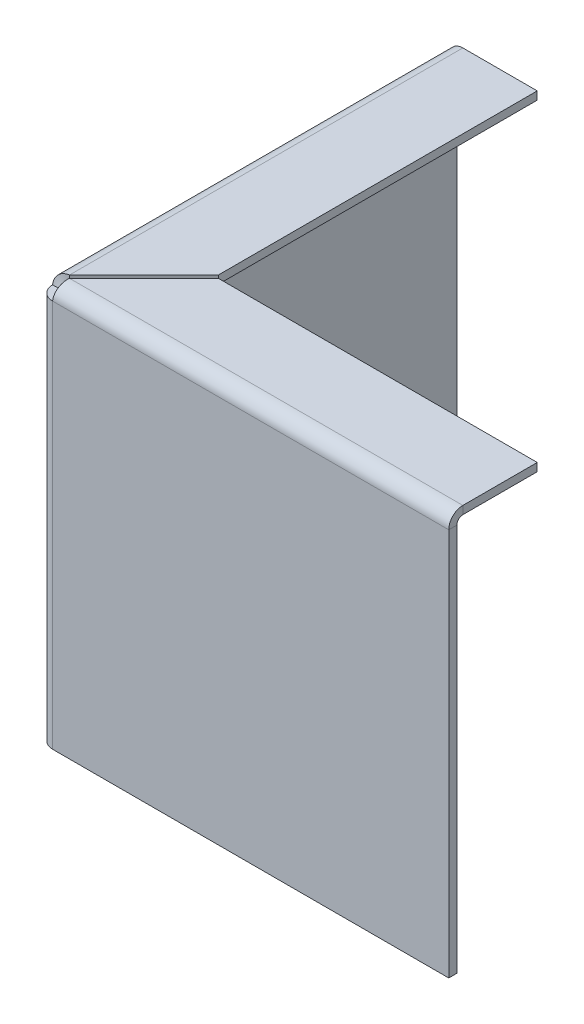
ISO-10303-21;
HEADER;
FILE_DESCRIPTION(('STEP AP214'),'2;1');
FILE_NAME('part.step','',(''),(''),'','','');
FILE_SCHEMA(('AUTOMOTIVE_DESIGN { 1 0 10303 214 1 1 1 1 }'));
ENDSEC;
DATA;
#1=APPLICATION_CONTEXT('core data for automotive mechanical design processes');
#2=APPLICATION_PROTOCOL_DEFINITION('international standard','automotive_design',2000,#1);
#3=PRODUCT_CONTEXT('',#1,'mechanical');
#4=PRODUCT('Part','Part','',(#3));
#5=PRODUCT_RELATED_PRODUCT_CATEGORY('part','',(#4));
#6=PRODUCT_DEFINITION_FORMATION('','',#4);
#7=PRODUCT_DEFINITION_CONTEXT('part definition',#1,'design');
#8=PRODUCT_DEFINITION('design','',#6,#7);
#9=PRODUCT_DEFINITION_SHAPE('','',#8);
#10=(LENGTH_UNIT() NAMED_UNIT(*) SI_UNIT(.MILLI.,.METRE.));
#11=(NAMED_UNIT(*) PLANE_ANGLE_UNIT() SI_UNIT($,.RADIAN.));
#12=(NAMED_UNIT(*) SI_UNIT($,.STERADIAN.) SOLID_ANGLE_UNIT());
#13=UNCERTAINTY_MEASURE_WITH_UNIT(LENGTH_MEASURE(1.E-05),#10,'distance_accuracy_value','');
#14=(GEOMETRIC_REPRESENTATION_CONTEXT(3) GLOBAL_UNCERTAINTY_ASSIGNED_CONTEXT((#13)) GLOBAL_UNIT_ASSIGNED_CONTEXT((#10,
#11,#12)) REPRESENTATION_CONTEXT('',''));
#15=CARTESIAN_POINT('',(0.,0.,0.));
#16=DIRECTION('',(0.,0.,1.));
#17=DIRECTION('',(1.,0.,0.));
#18=AXIS2_PLACEMENT_3D('',#15,#16,#17);
#19=CARTESIAN_POINT('',(1.5,46.5,-1.5));
#20=DIRECTION('',(0.,1.,0.));
#21=DIRECTION('',(0.,0.,1.));
#22=AXIS2_PLACEMENT_3D('',#19,#20,#21);
#23=PLANE('',#22);
#24=CARTESIAN_POINT('',(1.5,46.5,-1.5));
#25=DIRECTION('',(0.,1.,0.));
#26=DIRECTION('',(0.,0.,1.));
#27=AXIS2_PLACEMENT_3D('',#24,#25,#26);
#28=CIRCLE('',#27,1.5);
#29=CARTESIAN_POINT('',(0.,46.5,-1.5));
#30=VERTEX_POINT('',#29);
#31=CARTESIAN_POINT('',(1.5,46.5,0.));
#32=VERTEX_POINT('',#31);
#33=EDGE_CURVE('E83',#30,#32,#28,.T.);
#34=ORIENTED_EDGE('',*,*,#33,.F.);
#35=DIRECTION('',(-1.,0.,0.));
#36=VECTOR('',#35,1.);
#37=CARTESIAN_POINT('',(0.,46.5,-1.5));
#38=LINE('',#37,#36);
#39=CARTESIAN_POINT('',(-2.,46.5,-1.5));
#40=VERTEX_POINT('',#39);
#41=EDGE_CURVE('E244',#30,#40,#38,.T.);
#42=ORIENTED_EDGE('',*,*,#41,.T.);
#43=CARTESIAN_POINT('',(1.5,46.5,-1.5));
#44=DIRECTION('',(0.,1.,0.));
#45=DIRECTION('',(0.,0.,1.));
#46=AXIS2_PLACEMENT_3D('',#43,#44,#45);
#47=CIRCLE('',#46,3.5);
#48=CARTESIAN_POINT('',(1.5,46.5,2.));
#49=VERTEX_POINT('',#48);
#50=EDGE_CURVE('E13',#40,#49,#47,.T.);
#51=ORIENTED_EDGE('',*,*,#50,.T.);
#52=DIRECTION('',(0.,0.,1.));
#53=VECTOR('',#52,1.);
#54=CARTESIAN_POINT('',(1.5,46.5,0.));
#55=LINE('',#54,#53);
#56=EDGE_CURVE('E300',#32,#49,#55,.T.);
#57=ORIENTED_EDGE('',*,*,#56,.F.);
#58=EDGE_LOOP('',(#34,#42,#51,#57));
#59=FACE_BOUND('',#58,.T.);
#60=ADVANCED_FACE('F76',(#59),#23,.T.);
#61=CARTESIAN_POINT('',(0.,50.,0.));
#62=DIRECTION('',(1.,0.,0.));
#63=DIRECTION('',(0.,0.,-1.));
#64=AXIS2_PLACEMENT_3D('',#61,#62,#63);
#65=PLANE('',#64);
#66=DIRECTION('',(0.,-1.,0.));
#67=VECTOR('',#66,1.);
#68=CARTESIAN_POINT('',(0.,50.,-100.));
#69=LINE('',#68,#67);
#70=CARTESIAN_POINT('',(0.,46.5,-100.));
#71=VERTEX_POINT('',#70);
#72=CARTESIAN_POINT('',(0.,-50.,-100.));
#73=VERTEX_POINT('',#72);
#74=EDGE_CURVE('E312',#71,#73,#69,.T.);
#75=ORIENTED_EDGE('',*,*,#74,.F.);
#76=DIRECTION('',(0.,0.,1.));
#77=VECTOR('',#76,1.);
#78=CARTESIAN_POINT('',(0.,46.5,-1.5));
#79=LINE('',#78,#77);
#80=EDGE_CURVE('E247',#30,#71,#79,.F.);
#81=ORIENTED_EDGE('',*,*,#80,.F.);
#82=DIRECTION('',(0.,-1.,0.));
#83=VECTOR('',#82,1.);
#84=CARTESIAN_POINT('',(0.,50.,-1.5));
#85=LINE('',#84,#83);
#86=CARTESIAN_POINT('',(0.,-50.,-1.5));
#87=VERTEX_POINT('',#86);
#88=EDGE_CURVE('E303',#30,#87,#85,.T.);
#89=ORIENTED_EDGE('',*,*,#88,.T.);
#90=DIRECTION('',(0.,0.,1.));
#91=VECTOR('',#90,1.);
#92=CARTESIAN_POINT('',(0.,-50.,0.));
#93=LINE('',#92,#91);
#94=EDGE_CURVE('E334',#73,#87,#93,.T.);
#95=ORIENTED_EDGE('',*,*,#94,.F.);
#96=EDGE_LOOP('',(#75,#81,#89,#95));
#97=FACE_BOUND('',#96,.T.);
#98=ADVANCED_FACE('F289',(#97),#65,.T.);
#99=CARTESIAN_POINT('',(-2.,50.,0.));
#100=DIRECTION('',(1.,0.,0.));
#101=DIRECTION('',(0.,0.,-1.));
#102=AXIS2_PLACEMENT_3D('',#99,#100,#101);
#103=PLANE('',#102);
#104=DIRECTION('',(0.,0.,1.));
#105=VECTOR('',#104,1.);
#106=CARTESIAN_POINT('',(-2.,46.5,-1.5));
#107=LINE('',#106,#105);
#108=CARTESIAN_POINT('',(-2.,46.5,-100.));
#109=VERTEX_POINT('',#108);
#110=EDGE_CURVE('E194',#40,#109,#107,.F.);
#111=ORIENTED_EDGE('',*,*,#110,.T.);
#112=DIRECTION('',(0.,-1.,0.));
#113=VECTOR('',#112,1.);
#114=CARTESIAN_POINT('',(-2.,50.,-100.));
#115=LINE('',#114,#113);
#116=CARTESIAN_POINT('',(-2.,-50.,-100.));
#117=VERTEX_POINT('',#116);
#118=EDGE_CURVE('E316',#109,#117,#115,.T.);
#119=ORIENTED_EDGE('',*,*,#118,.T.);
#120=DIRECTION('',(0.,0.,-1.));
#121=VECTOR('',#120,1.);
#122=CARTESIAN_POINT('',(-2.,-50.,0.));
#123=LINE('',#122,#121);
#124=CARTESIAN_POINT('',(-2.,-50.,-1.5));
#125=VERTEX_POINT('',#124);
#126=EDGE_CURVE('E332',#117,#125,#123,.F.);
#127=ORIENTED_EDGE('',*,*,#126,.T.);
#128=DIRECTION('',(0.,-1.,0.));
#129=VECTOR('',#128,1.);
#130=CARTESIAN_POINT('',(-2.,50.,-1.5));
#131=LINE('',#130,#129);
#132=EDGE_CURVE('E338',#40,#125,#131,.T.);
#133=ORIENTED_EDGE('',*,*,#132,.F.);
#134=EDGE_LOOP('',(#111,#119,#127,#133));
#135=FACE_BOUND('',#134,.T.);
#136=ADVANCED_FACE('F294',(#135),#103,.F.);
#137=CARTESIAN_POINT('',(1.5,50.,-1.5));
#138=DIRECTION('',(0.,-1.,0.));
#139=DIRECTION('',(0.,0.,-1.));
#140=AXIS2_PLACEMENT_3D('',#137,#138,#139);
#141=CYLINDRICAL_SURFACE('',#140,1.5);
#142=ORIENTED_EDGE('',*,*,#88,.F.);
#143=ORIENTED_EDGE('',*,*,#33,.T.);
#144=DIRECTION('',(0.,-1.,0.));
#145=VECTOR('',#144,1.);
#146=CARTESIAN_POINT('',(1.5,50.,0.));
#147=LINE('',#146,#145);
#148=CARTESIAN_POINT('',(1.5,-50.,0.));
#149=VERTEX_POINT('',#148);
#150=EDGE_CURVE('E311',#32,#149,#147,.T.);
#151=ORIENTED_EDGE('',*,*,#150,.T.);
#152=CARTESIAN_POINT('',(1.5,-50.,-1.5));
#153=DIRECTION('',(0.,-1.,0.));
#154=DIRECTION('',(0.,0.,-1.));
#155=AXIS2_PLACEMENT_3D('',#152,#153,#154);
#156=CIRCLE('',#155,1.5);
#157=EDGE_CURVE('E306',#87,#149,#156,.F.);
#158=ORIENTED_EDGE('',*,*,#157,.F.);
#159=EDGE_LOOP('',(#142,#143,#151,#158));
#160=FACE_BOUND('',#159,.T.);
#161=ADVANCED_FACE('F304',(#160),#141,.F.);
#162=CARTESIAN_POINT('',(0.,50.,2.));
#163=DIRECTION('',(0.,0.,-1.));
#164=DIRECTION('',(-1.,0.,0.));
#165=AXIS2_PLACEMENT_3D('',#162,#163,#164);
#166=PLANE('',#165);
#167=DIRECTION('',(1.,0.,0.));
#168=VECTOR('',#167,1.);
#169=CARTESIAN_POINT('',(100.,46.5,1.99999999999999));
#170=LINE('',#169,#168);
#171=CARTESIAN_POINT('',(100.,46.5,1.99999999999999));
#172=VERTEX_POINT('',#171);
#173=EDGE_CURVE('E360',#172,#49,#170,.F.);
#174=ORIENTED_EDGE('',*,*,#173,.T.);
#175=DIRECTION('',(0.,-1.,0.));
#176=VECTOR('',#175,1.);
#177=CARTESIAN_POINT('',(1.5,50.,2.));
#178=LINE('',#177,#176);
#179=CARTESIAN_POINT('',(1.5,-50.,2.));
#180=VERTEX_POINT('',#179);
#181=EDGE_CURVE('E350',#49,#180,#178,.T.);
#182=ORIENTED_EDGE('',*,*,#181,.T.);
#183=DIRECTION('',(1.,0.,0.));
#184=VECTOR('',#183,1.);
#185=CARTESIAN_POINT('',(0.,-50.,2.));
#186=LINE('',#185,#184);
#187=CARTESIAN_POINT('',(100.,-50.,2.));
#188=VERTEX_POINT('',#187);
#189=EDGE_CURVE('E376',#180,#188,#186,.T.);
#190=ORIENTED_EDGE('',*,*,#189,.T.);
#191=DIRECTION('',(0.,-1.,0.));
#192=VECTOR('',#191,1.);
#193=CARTESIAN_POINT('',(100.,50.,2.));
#194=LINE('',#193,#192);
#195=EDGE_CURVE('E321',#172,#188,#194,.T.);
#196=ORIENTED_EDGE('',*,*,#195,.F.);
#197=EDGE_LOOP('',(#174,#182,#190,#196));
#198=FACE_BOUND('',#197,.T.);
#199=ADVANCED_FACE('F361',(#198),#166,.F.);
#200=CARTESIAN_POINT('',(100.,50.,0.));
#201=DIRECTION('',(1.,0.,0.));
#202=DIRECTION('',(0.,0.,-1.));
#203=AXIS2_PLACEMENT_3D('',#200,#201,#202);
#204=PLANE('',#203);
#205=DIRECTION('',(0.,-1.,0.));
#206=VECTOR('',#205,1.);
#207=CARTESIAN_POINT('',(100.,50.,0.));
#208=LINE('',#207,#206);
#209=CARTESIAN_POINT('',(100.,46.5,0.));
#210=VERTEX_POINT('',#209);
#211=CARTESIAN_POINT('',(100.,-50.,0.));
#212=VERTEX_POINT('',#211);
#213=EDGE_CURVE('E314',#210,#212,#208,.T.);
#214=ORIENTED_EDGE('',*,*,#213,.F.);
#215=DIRECTION('',(0.,0.,1.));
#216=VECTOR('',#215,1.);
#217=CARTESIAN_POINT('',(100.,46.5,0.));
#218=LINE('',#217,#216);
#219=EDGE_CURVE('E377',#210,#172,#218,.T.);
#220=ORIENTED_EDGE('',*,*,#219,.T.);
#221=ORIENTED_EDGE('',*,*,#195,.T.);
#222=DIRECTION('',(0.,0.,1.));
#223=VECTOR('',#222,1.);
#224=CARTESIAN_POINT('',(100.,-50.,0.));
#225=LINE('',#224,#223);
#226=EDGE_CURVE('E713',#212,#188,#225,.T.);
#227=ORIENTED_EDGE('',*,*,#226,.F.);
#228=EDGE_LOOP('',(#214,#220,#221,#227));
#229=FACE_BOUND('',#228,.T.);
#230=ADVANCED_FACE('F439',(#229),#204,.T.);
#231=CARTESIAN_POINT('',(0.,50.,0.));
#232=DIRECTION('',(0.,0.,-1.));
#233=DIRECTION('',(-1.,0.,0.));
#234=AXIS2_PLACEMENT_3D('',#231,#232,#233);
#235=PLANE('',#234);
#236=ORIENTED_EDGE('',*,*,#150,.F.);
#237=DIRECTION('',(1.,0.,0.));
#238=VECTOR('',#237,1.);
#239=CARTESIAN_POINT('',(100.,46.5,0.));
#240=LINE('',#239,#238);
#241=EDGE_CURVE('E90',#210,#32,#240,.F.);
#242=ORIENTED_EDGE('',*,*,#241,.F.);
#243=ORIENTED_EDGE('',*,*,#213,.T.);
#244=DIRECTION('',(1.,0.,0.));
#245=VECTOR('',#244,1.);
#246=CARTESIAN_POINT('',(0.,-50.,0.));
#247=LINE('',#246,#245);
#248=EDGE_CURVE('E710',#149,#212,#247,.T.);
#249=ORIENTED_EDGE('',*,*,#248,.F.);
#250=EDGE_LOOP('',(#236,#242,#243,#249));
#251=FACE_BOUND('',#250,.T.);
#252=ADVANCED_FACE('F436',(#251),#235,.T.);
#253=CARTESIAN_POINT('',(0.,-50.,-1.5));
#254=DIRECTION('',(0.,-1.,0.));
#255=DIRECTION('',(0.,0.,-1.));
#256=AXIS2_PLACEMENT_3D('',#253,#254,#255);
#257=PLANE('',#256);
#258=DIRECTION('',(-1.,0.,0.));
#259=VECTOR('',#258,1.);
#260=CARTESIAN_POINT('',(0.,-50.,-1.5));
#261=LINE('',#260,#259);
#262=EDGE_CURVE('E301',#87,#125,#261,.T.);
#263=ORIENTED_EDGE('',*,*,#262,.F.);
#264=ORIENTED_EDGE('',*,*,#157,.T.);
#265=DIRECTION('',(0.,0.,-1.));
#266=VECTOR('',#265,1.);
#267=CARTESIAN_POINT('',(1.5,-50.,2.));
#268=LINE('',#267,#266);
#269=EDGE_CURVE('E323',#180,#149,#268,.T.);
#270=ORIENTED_EDGE('',*,*,#269,.F.);
#271=CARTESIAN_POINT('',(1.5,-50.,-1.5));
#272=DIRECTION('',(0.,1.,0.));
#273=DIRECTION('',(1.,0.,0.));
#274=AXIS2_PLACEMENT_3D('',#271,#272,#273);
#275=CIRCLE('',#274,3.5);
#276=EDGE_CURVE('E341',#125,#180,#275,.T.);
#277=ORIENTED_EDGE('',*,*,#276,.F.);
#278=EDGE_LOOP('',(#263,#264,#270,#277));
#279=FACE_BOUND('',#278,.T.);
#280=ADVANCED_FACE('F346',(#279),#257,.T.);
#281=CARTESIAN_POINT('',(1.5,-50.,2.));
#282=DIRECTION('',(0.,-1.,0.));
#283=DIRECTION('',(0.,0.,-1.));
#284=AXIS2_PLACEMENT_3D('',#281,#282,#283);
#285=PLANE('',#284);
#286=ORIENTED_EDGE('',*,*,#94,.T.);
#287=ORIENTED_EDGE('',*,*,#262,.T.);
#288=ORIENTED_EDGE('',*,*,#126,.F.);
#289=DIRECTION('',(1.,0.,0.));
#290=VECTOR('',#289,1.);
#291=CARTESIAN_POINT('',(-2.,-50.,-100.));
#292=LINE('',#291,#290);
#293=EDGE_CURVE('E342',#117,#73,#292,.T.);
#294=ORIENTED_EDGE('',*,*,#293,.T.);
#295=EDGE_LOOP('',(#286,#287,#288,#294));
#296=FACE_BOUND('',#295,.T.);
#297=ADVANCED_FACE('F330',(#296),#285,.T.);
#298=CARTESIAN_POINT('',(-2.,50.,-100.));
#299=DIRECTION('',(0.,0.,-1.));
#300=DIRECTION('',(-1.,0.,0.));
#301=AXIS2_PLACEMENT_3D('',#298,#299,#300);
#302=PLANE('',#301);
#303=DIRECTION('',(-1.,0.,0.));
#304=VECTOR('',#303,1.);
#305=CARTESIAN_POINT('',(0.,46.5,-100.));
#306=LINE('',#305,#304);
#307=EDGE_CURVE('E250',#71,#109,#306,.T.);
#308=ORIENTED_EDGE('',*,*,#307,.F.);
#309=ORIENTED_EDGE('',*,*,#74,.T.);
#310=ORIENTED_EDGE('',*,*,#293,.F.);
#311=ORIENTED_EDGE('',*,*,#118,.F.);
#312=EDGE_LOOP('',(#308,#309,#310,#311));
#313=FACE_BOUND('',#312,.T.);
#314=ADVANCED_FACE('F428',(#313),#302,.T.);
#315=CARTESIAN_POINT('',(1.5,50.,-1.5));
#316=DIRECTION('',(0.,-1.,0.));
#317=DIRECTION('',(0.,0.,-1.));
#318=AXIS2_PLACEMENT_3D('',#315,#316,#317);
#319=CYLINDRICAL_SURFACE('',#318,3.5);
#320=ORIENTED_EDGE('',*,*,#50,.F.);
#321=ORIENTED_EDGE('',*,*,#132,.T.);
#322=ORIENTED_EDGE('',*,*,#276,.T.);
#323=ORIENTED_EDGE('',*,*,#181,.F.);
#324=EDGE_LOOP('',(#320,#321,#322,#323));
#325=FACE_BOUND('',#324,.T.);
#326=ADVANCED_FACE('F355',(#325),#319,.T.);
#327=CARTESIAN_POINT('',(1.5,-50.,-1.5));
#328=DIRECTION('',(0.,-1.,0.));
#329=DIRECTION('',(0.,0.,-1.));
#330=AXIS2_PLACEMENT_3D('',#327,#328,#329);
#331=PLANE('',#330);
#332=ORIENTED_EDGE('',*,*,#189,.F.);
#333=ORIENTED_EDGE('',*,*,#269,.T.);
#334=ORIENTED_EDGE('',*,*,#248,.T.);
#335=ORIENTED_EDGE('',*,*,#226,.T.);
#336=EDGE_LOOP('',(#332,#333,#334,#335));
#337=FACE_BOUND('',#336,.T.);
#338=ADVANCED_FACE('F420',(#337),#331,.T.);
#339=CARTESIAN_POINT('',(1.5,46.5,2.02));
#340=CARTESIAN_POINT('',(1.55893602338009,46.9608486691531,2.02));
#341=CARTESIAN_POINT('',(1.61785113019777,47.4213525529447,1.92838382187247));
#342=CARTESIAN_POINT('',(1.73570226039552,48.2727388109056,1.57572808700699));
#343=CARTESIAN_POINT('',(1.79462782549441,48.6632044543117,1.3148272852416));
#344=CARTESIAN_POINT('',(1.91247895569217,49.3148272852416,0.663204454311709));
#345=CARTESIAN_POINT('',(1.97140452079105,49.575728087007,0.272738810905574));
#346=CARTESIAN_POINT('',(2.08925565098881,49.9283838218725,-0.578647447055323));
#347=CARTESIAN_POINT('',(2.14817075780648,50.02,-1.03915133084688));
#348=CARTESIAN_POINT('',(2.20710678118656,50.02,-1.49999999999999));
#349=CARTESIAN_POINT('',(1.5,46.5,2.));
#350=CARTESIAN_POINT('',(1.55893601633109,46.9582301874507,2.));
#351=CARTESIAN_POINT('',(1.61785113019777,47.4161175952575,1.90890436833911));
#352=CARTESIAN_POINT('',(1.73570226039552,48.2626664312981,1.55825235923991));
#353=CARTESIAN_POINT('',(1.79462782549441,48.6509135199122,1.29883394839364));
#354=CARTESIAN_POINT('',(1.91247895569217,49.2988339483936,0.650913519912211));
#355=CARTESIAN_POINT('',(1.97140452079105,49.5582523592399,0.262666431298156));
#356=CARTESIAN_POINT('',(2.08925565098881,49.9089043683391,-0.583882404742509));
#357=CARTESIAN_POINT('',(2.14817076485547,50.,-1.04176981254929));
#358=CARTESIAN_POINT('',(2.20710678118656,50.,-1.49999999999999));
#359=CARTESIAN_POINT('',(1.5,46.5,0.));
#360=CARTESIAN_POINT('',(1.55893531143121,46.6963820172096,0.));
#361=CARTESIAN_POINT('',(1.61785113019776,46.8926218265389,-0.0390409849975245));
#362=CARTESIAN_POINT('',(1.73570226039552,47.2554284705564,-0.18932041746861));
#363=CARTESIAN_POINT('',(1.79462782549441,47.4218200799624,-0.300499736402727));
#364=CARTESIAN_POINT('',(1.91247895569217,47.6995002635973,-0.578179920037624));
#365=CARTESIAN_POINT('',(1.97140452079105,47.8106795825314,-0.744571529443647));
#366=CARTESIAN_POINT('',(2.08925565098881,47.9609590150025,-1.10737817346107));
#367=CARTESIAN_POINT('',(2.14817146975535,48.,-1.3036179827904));
#368=CARTESIAN_POINT('',(2.20710678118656,48.,-1.49999999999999));
#369=CARTESIAN_POINT('',(1.5,46.5,-0.020199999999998));
#370=CARTESIAN_POINT('',(1.55893530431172,46.6937373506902,-0.020199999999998));
#371=CARTESIAN_POINT('',(1.61785113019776,46.8873345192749,-0.0587152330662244));
#372=CARTESIAN_POINT('',(1.73570226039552,47.2452553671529,-0.206970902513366));
#373=CARTESIAN_POINT('',(1.79462782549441,47.4094062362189,-0.31665300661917));
#374=CARTESIAN_POINT('',(1.91247895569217,47.6833469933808,-0.590593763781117));
#375=CARTESIAN_POINT('',(1.97140452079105,47.7930290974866,-0.754744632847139));
#376=CARTESIAN_POINT('',(2.08925565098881,47.9412847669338,-1.11266548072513));
#377=CARTESIAN_POINT('',(2.14817147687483,47.9798,-1.30626264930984));
#378=CARTESIAN_POINT('',(2.20710678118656,47.9798,-1.49999999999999));
#379=B_SPLINE_SURFACE_WITH_KNOTS('',1,3,((#339,#340,#341,#342,#343,#344,#345,#346,#347,#348),
(#349,#350,#351,#352,#353,#354,#355,#356,#357,#358),(#359,#360,#361,#362,#363,#364,#365,#366,
#367,#368),(#369,#370,#371,#372,#373,#374,#375,#376,#377,#378)),.UNSPECIFIED.,.F.,.F.,.F.,(2,1,
1,2),(4,2,2,2,4),(-0.01,0.,1.,1.0101),(0.,0.25,0.5,0.75,1.),.UNSPECIFIED.);
#380=DIRECTION('',(0.,-1.,0.));
#381=VECTOR('',#380,1.);
#382=CARTESIAN_POINT('',(2.20710678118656,48.,-1.49999999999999));
#383=LINE('',#382,#381);
#384=CARTESIAN_POINT('',(2.20710678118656,50.,-1.49999999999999));
#385=VERTEX_POINT('',#384);
#386=CARTESIAN_POINT('',(2.20710678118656,48.,-1.49999999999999));
#387=VERTEX_POINT('',#386);
#388=EDGE_CURVE('E724',#385,#387,#383,.T.);
#389=CARTESIAN_POINT('',(1.5,46.5,0.));
#390=CARTESIAN_POINT('',(1.51323203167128,46.544087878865,3.47034439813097E-08));
#391=CARTESIAN_POINT('',(1.52645702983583,46.5881548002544,-0.00194500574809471));
#392=CARTESIAN_POINT('',(1.55290576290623,46.6759447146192,-0.00970236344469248));
#393=CARTESIAN_POINT('',(1.56612949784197,46.7196677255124,-0.0155144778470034));
#394=CARTESIAN_POINT('',(1.60577560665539,46.8497289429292,-0.0386914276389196));
#395=CARTESIAN_POINT('',(1.6322172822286,46.9351095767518,-0.0617970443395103));
#396=CARTESIAN_POINT('',(1.68510275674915,47.1004990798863,-0.122618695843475));
#397=CARTESIAN_POINT('',(1.71154654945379,47.1805050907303,-0.160342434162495));
#398=CARTESIAN_POINT('',(1.76442843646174,47.3326583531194,-0.24922586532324));
#399=CARTESIAN_POINT('',(1.79086653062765,47.4048074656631,-0.30038236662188));
#400=CARTESIAN_POINT('',(1.84373599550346,47.5389938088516,-0.414527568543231));
#401=CARTESIAN_POINT('',(1.87016736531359,47.6010345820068,-0.477512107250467));
#402=CARTESIAN_POINT('',(1.92303667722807,47.7131409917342,-0.613406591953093));
#403=CARTESIAN_POINT('',(1.94947461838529,47.7632024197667,-0.68632001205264));
#404=CARTESIAN_POINT('',(2.00236028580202,47.8497847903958,-0.839808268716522));
#405=CARTESIAN_POINT('',(2.0288080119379,47.8863005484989,-0.920386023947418));
#406=CARTESIAN_POINT('',(2.08168604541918,47.9446056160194,-1.0866535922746));
#407=CARTESIAN_POINT('',(2.10811633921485,47.9664113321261,-1.17233759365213));
#408=CARTESIAN_POINT('',(2.14663141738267,47.9870239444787,-1.29901251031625));
#409=CARTESIAN_POINT('',(2.15873784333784,47.991890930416,-1.33909206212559));
#410=CARTESIAN_POINT('',(2.18292971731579,47.9983756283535,-1.4194417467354));
#411=CARTESIAN_POINT('',(2.1950151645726,47.9999990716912,-1.45971141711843));
#412=CARTESIAN_POINT('',(2.20710678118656,48.,-1.49999999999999));
#413=B_SPLINE_CURVE_WITH_KNOTS('',3,(#389,#390,#391,#392,#393,#394,#395,#396,#397,#398,#399,
#400,#401,#402,#403,#404,#405,#406,#407,#408,#409,#410,#411,#412),.UNSPECIFIED.,.F.,.F.,(4,2,2,
2,2,2,2,2,2,2,2,4),(0.,0.138007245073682,0.276007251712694,0.551543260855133,0.827224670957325,
1.10284064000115,1.37835980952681,1.65397563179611,1.92969683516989,2.20511000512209,
2.33145445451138,2.45757545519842),.UNSPECIFIED.);
#414=EDGE_CURVE('E375',#32,#387,#413,.T.);
#415=CARTESIAN_POINT('',(1.5,46.5,2.));
#416=CARTESIAN_POINT('',(1.51087138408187,46.5845222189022,2.00000086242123));
#417=CARTESIAN_POINT('',(1.5217393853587,46.6690184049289,1.99693729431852));
#418=CARTESIAN_POINT('',(1.54347358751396,46.837556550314,1.98470877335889));
#419=CARTESIAN_POINT('',(1.55433978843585,46.9215985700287,1.97554465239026));
#420=CARTESIAN_POINT('',(1.58694391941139,47.1724467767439,1.93894551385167));
#421=CARTESIAN_POINT('',(1.60869103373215,47.3380038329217,1.90240370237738));
#422=CARTESIAN_POINT('',(1.65595944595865,47.6901951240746,1.79739226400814));
#423=CARTESIAN_POINT('',(1.68148204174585,47.8755133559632,1.72448884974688));
#424=CARTESIAN_POINT('',(1.73252534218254,48.2311482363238,1.54836167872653));
#425=CARTESIAN_POINT('',(1.75804604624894,48.4014631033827,1.44513432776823));
#426=CARTESIAN_POINT('',(1.80908833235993,48.7221529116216,1.21134787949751));
#427=CARTESIAN_POINT('',(1.83460991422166,48.872529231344,1.08079067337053));
#428=CARTESIAN_POINT('',(1.88565391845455,49.1490209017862,0.796097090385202));
#429=CARTESIAN_POINT('',(1.91117634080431,49.2751350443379,0.641959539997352));
#430=CARTESIAN_POINT('',(1.96222216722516,49.499465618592,0.314552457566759));
#431=CARTESIAN_POINT('',(1.987745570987,49.5976783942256,0.141280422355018));
#432=CARTESIAN_POINT('',(2.03879264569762,49.7633354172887,-0.219379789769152));
#433=CARTESIAN_POINT('',(2.06431631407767,49.8307892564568,-0.406763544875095));
#434=CARTESIAN_POINT('',(2.10938700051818,49.9210625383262,-0.745364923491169));
#435=CARTESIAN_POINT('',(2.12893945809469,49.9506230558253,-0.894823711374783));
#436=CARTESIAN_POINT('',(2.16802725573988,49.9901050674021,-1.19616968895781));
#437=CARTESIAN_POINT('',(2.18756259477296,50.0000448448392,-1.34805448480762));
#438=CARTESIAN_POINT('',(2.20710678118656,50.,-1.49999999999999));
#439=B_SPLINE_CURVE_WITH_KNOTS('',3,(#415,#416,#417,#418,#419,#420,#421,#422,#423,#424,#425,
#426,#427,#428,#429,#430,#431,#432,#433,#434,#435,#436,#437,#438),.UNSPECIFIED.,.F.,.F.,(4,2,2,
2,2,2,2,2,2,2,2,4),(0.,0.25554825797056,0.51106167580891,1.0220024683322,1.62144032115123,
2.22094925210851,2.82041671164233,3.41991401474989,4.01948983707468,4.61887856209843,
5.07846141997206,5.53761581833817),.UNSPECIFIED.);
#440=EDGE_CURVE('E366',#49,#385,#439,.T.);
#441=ORIENTED_EDGE('',*,*,#388,.T.);
#442=ORIENTED_EDGE('',*,*,#414,.F.);
#443=ORIENTED_EDGE('',*,*,#56,.T.);
#444=ORIENTED_EDGE('',*,*,#440,.T.);
#445=EDGE_LOOP('',(#441,#442,#443,#444));
#446=FACE_BOUND('',#445,.T.);
#447=ADVANCED_FACE('F372',(#446),#379,.F.);
#448=CARTESIAN_POINT('',(100.,46.5,-1.50000000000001));
#449=DIRECTION('',(-1.,0.,0.));
#450=DIRECTION('',(0.,0.,1.));
#451=AXIS2_PLACEMENT_3D('',#448,#449,#450);
#452=PLANE('',#451);
#453=CARTESIAN_POINT('',(100.,46.5,-1.50000000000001));
#454=DIRECTION('',(1.,0.,0.));
#455=DIRECTION('',(0.,0.,-1.));
#456=AXIS2_PLACEMENT_3D('',#453,#454,#455);
#457=CIRCLE('',#456,1.5);
#458=CARTESIAN_POINT('',(100.,48.,-1.5));
#459=VERTEX_POINT('',#458);
#460=EDGE_CURVE('E720',#459,#210,#457,.T.);
#461=ORIENTED_EDGE('',*,*,#460,.F.);
#462=DIRECTION('',(0.,-1.,0.));
#463=VECTOR('',#462,1.);
#464=CARTESIAN_POINT('',(100.,48.,-1.5));
#465=LINE('',#464,#463);
#466=CARTESIAN_POINT('',(100.,50.,-1.49999999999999));
#467=VERTEX_POINT('',#466);
#468=EDGE_CURVE('E732',#459,#467,#465,.F.);
#469=ORIENTED_EDGE('',*,*,#468,.T.);
#470=CARTESIAN_POINT('',(100.,46.5,-1.50000000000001));
#471=DIRECTION('',(1.,0.,0.));
#472=DIRECTION('',(0.,0.,-1.));
#473=AXIS2_PLACEMENT_3D('',#470,#471,#472);
#474=CIRCLE('',#473,3.5);
#475=EDGE_CURVE('E367',#467,#172,#474,.T.);
#476=ORIENTED_EDGE('',*,*,#475,.T.);
#477=ORIENTED_EDGE('',*,*,#219,.F.);
#478=EDGE_LOOP('',(#461,#469,#476,#477));
#479=FACE_BOUND('',#478,.T.);
#480=ADVANCED_FACE('F403',(#479),#452,.F.);
#481=CARTESIAN_POINT('',(100.,46.5,-1.50000000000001));
#482=DIRECTION('',(1.,0.,0.));
#483=DIRECTION('',(0.,1.,0.));
#484=AXIS2_PLACEMENT_3D('',#481,#482,#483);
#485=CYLINDRICAL_SURFACE('',#484,3.5);
#486=ORIENTED_EDGE('',*,*,#173,.F.);
#487=ORIENTED_EDGE('',*,*,#475,.F.);
#488=DIRECTION('',(1.,0.,0.));
#489=VECTOR('',#488,1.);
#490=CARTESIAN_POINT('',(1.5,50.,-1.49999999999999));
#491=LINE('',#490,#489);
#492=EDGE_CURVE('E381',#467,#385,#491,.F.);
#493=ORIENTED_EDGE('',*,*,#492,.T.);
#494=ORIENTED_EDGE('',*,*,#440,.F.);
#495=EDGE_LOOP('',(#486,#487,#493,#494));
#496=FACE_BOUND('',#495,.T.);
#497=ADVANCED_FACE('F379',(#496),#485,.T.);
#498=CARTESIAN_POINT('',(100.,46.5,-1.50000000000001));
#499=DIRECTION('',(1.,0.,0.));
#500=DIRECTION('',(0.,1.,0.));
#501=AXIS2_PLACEMENT_3D('',#498,#499,#500);
#502=CYLINDRICAL_SURFACE('',#501,1.5);
#503=ORIENTED_EDGE('',*,*,#241,.T.);
#504=ORIENTED_EDGE('',*,*,#414,.T.);
#505=DIRECTION('',(1.,0.,0.));
#506=VECTOR('',#505,1.);
#507=CARTESIAN_POINT('',(1.5,48.,-1.49999999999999));
#508=LINE('',#507,#506);
#509=EDGE_CURVE('E723',#387,#459,#508,.T.);
#510=ORIENTED_EDGE('',*,*,#509,.T.);
#511=ORIENTED_EDGE('',*,*,#460,.T.);
#512=EDGE_LOOP('',(#503,#504,#510,#511));
#513=FACE_BOUND('',#512,.T.);
#514=ADVANCED_FACE('F402',(#513),#502,.F.);
#515=CARTESIAN_POINT('',(1.5,50.0000000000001,-20.));
#516=DIRECTION('',(0.,-1.,0.));
#517=DIRECTION('',(0.,0.,-1.));
#518=AXIS2_PLACEMENT_3D('',#515,#516,#517);
#519=PLANE('',#518);
#520=DIRECTION('',(0.70710678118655,0.,-0.707106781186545));
#521=VECTOR('',#520,1.);
#522=CARTESIAN_POINT('',(2.20710678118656,50.,-1.49999999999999));
#523=LINE('',#522,#521);
#524=CARTESIAN_POINT('',(20.7071067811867,50.0000000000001,-20.));
#525=VERTEX_POINT('',#524);
#526=EDGE_CURVE('E252',#385,#525,#523,.T.);
#527=ORIENTED_EDGE('',*,*,#526,.F.);
#528=ORIENTED_EDGE('',*,*,#492,.F.);
#529=DIRECTION('',(0.,0.,-1.));
#530=VECTOR('',#529,1.);
#531=CARTESIAN_POINT('',(100.,50.0000000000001,-20.));
#532=LINE('',#531,#530);
#533=CARTESIAN_POINT('',(100.,50.0000000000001,-20.));
#534=VERTEX_POINT('',#533);
#535=EDGE_CURVE('E741',#467,#534,#532,.T.);
#536=ORIENTED_EDGE('',*,*,#535,.T.);
#537=DIRECTION('',(-1.,0.,0.));
#538=VECTOR('',#537,1.);
#539=CARTESIAN_POINT('',(1.5,50.0000000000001,-20.));
#540=LINE('',#539,#538);
#541=EDGE_CURVE('E743',#534,#525,#540,.T.);
#542=ORIENTED_EDGE('',*,*,#541,.T.);
#543=EDGE_LOOP('',(#527,#528,#536,#542));
#544=FACE_BOUND('',#543,.T.);
#545=ADVANCED_FACE('F407',(#544),#519,.F.);
#546=CARTESIAN_POINT('',(1.5,48.0000000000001,-20.));
#547=DIRECTION('',(0.,-1.,0.));
#548=DIRECTION('',(0.,0.,-1.));
#549=AXIS2_PLACEMENT_3D('',#546,#547,#548);
#550=PLANE('',#549);
#551=ORIENTED_EDGE('',*,*,#509,.F.);
#552=DIRECTION('',(0.70710678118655,0.,-0.707106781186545));
#553=VECTOR('',#552,1.);
#554=CARTESIAN_POINT('',(11.1035533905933,48.,-10.3964466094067));
#555=LINE('',#554,#553);
#556=CARTESIAN_POINT('',(20.7071067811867,48.0000000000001,-20.));
#557=VERTEX_POINT('',#556);
#558=EDGE_CURVE('E733',#387,#557,#555,.T.);
#559=ORIENTED_EDGE('',*,*,#558,.T.);
#560=DIRECTION('',(1.,0.,0.));
#561=VECTOR('',#560,1.);
#562=CARTESIAN_POINT('',(1.5,48.0000000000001,-20.));
#563=LINE('',#562,#561);
#564=CARTESIAN_POINT('',(100.,48.0000000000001,-20.));
#565=VERTEX_POINT('',#564);
#566=EDGE_CURVE('E738',#565,#557,#563,.F.);
#567=ORIENTED_EDGE('',*,*,#566,.F.);
#568=DIRECTION('',(0.,0.,1.));
#569=VECTOR('',#568,1.);
#570=CARTESIAN_POINT('',(100.,48.0000000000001,-20.));
#571=LINE('',#570,#569);
#572=EDGE_CURVE('E736',#459,#565,#571,.F.);
#573=ORIENTED_EDGE('',*,*,#572,.F.);
#574=EDGE_LOOP('',(#551,#559,#567,#573));
#575=FACE_BOUND('',#574,.T.);
#576=ADVANCED_FACE('F412',(#575),#550,.T.);
#577=CARTESIAN_POINT('',(1.5,50.0000000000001,-20.));
#578=DIRECTION('',(0.,0.,1.));
#579=DIRECTION('',(0.,-1.,0.));
#580=AXIS2_PLACEMENT_3D('',#577,#578,#579);
#581=PLANE('',#580);
#582=DIRECTION('',(0.,-1.,0.));
#583=VECTOR('',#582,1.);
#584=CARTESIAN_POINT('',(20.7071067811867,50.0000000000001,-20.));
#585=LINE('',#584,#583);
#586=EDGE_CURVE('E750',#525,#557,#585,.T.);
#587=ORIENTED_EDGE('',*,*,#586,.F.);
#588=ORIENTED_EDGE('',*,*,#541,.F.);
#589=DIRECTION('',(0.,-1.,0.));
#590=VECTOR('',#589,1.);
#591=CARTESIAN_POINT('',(100.,50.0000000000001,-20.));
#592=LINE('',#591,#590);
#593=EDGE_CURVE('E727',#534,#565,#592,.T.);
#594=ORIENTED_EDGE('',*,*,#593,.T.);
#595=ORIENTED_EDGE('',*,*,#566,.T.);
#596=EDGE_LOOP('',(#587,#588,#594,#595));
#597=FACE_BOUND('',#596,.T.);
#598=ADVANCED_FACE('F506',(#597),#581,.F.);
#599=CARTESIAN_POINT('',(100.,50.0000000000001,-20.));
#600=DIRECTION('',(-1.,0.,0.));
#601=DIRECTION('',(0.,0.,1.));
#602=AXIS2_PLACEMENT_3D('',#599,#600,#601);
#603=PLANE('',#602);
#604=ORIENTED_EDGE('',*,*,#468,.F.);
#605=ORIENTED_EDGE('',*,*,#572,.T.);
#606=ORIENTED_EDGE('',*,*,#593,.F.);
#607=ORIENTED_EDGE('',*,*,#535,.F.);
#608=EDGE_LOOP('',(#604,#605,#606,#607));
#609=FACE_BOUND('',#608,.T.);
#610=ADVANCED_FACE('F286',(#609),#603,.F.);
#611=CARTESIAN_POINT('',(2.20710678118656,50.,-1.49999999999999));
#612=DIRECTION('',(-0.707106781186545,0.,-0.70710678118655));
#613=DIRECTION('',(-0.70710678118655,0.,0.707106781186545));
#614=AXIS2_PLACEMENT_3D('',#611,#612,#613);
#615=PLANE('',#614);
#616=ORIENTED_EDGE('',*,*,#558,.F.);
#617=ORIENTED_EDGE('',*,*,#388,.F.);
#618=ORIENTED_EDGE('',*,*,#526,.T.);
#619=ORIENTED_EDGE('',*,*,#586,.T.);
#620=EDGE_LOOP('',(#616,#617,#618,#619));
#621=FACE_BOUND('',#620,.T.);
#622=ADVANCED_FACE('F280',(#621),#615,.T.);
#623=CARTESIAN_POINT('',(1.5,46.5,-100.));
#624=DIRECTION('',(0.,0.,-1.));
#625=DIRECTION('',(-1.,0.,0.));
#626=AXIS2_PLACEMENT_3D('',#623,#624,#625);
#627=PLANE('',#626);
#628=DIRECTION('',(0.,-1.,0.));
#629=VECTOR('',#628,1.);
#630=CARTESIAN_POINT('',(1.49999999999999,50.,-100.));
#631=LINE('',#630,#629);
#632=CARTESIAN_POINT('',(1.5,48.,-100.));
#633=VERTEX_POINT('',#632);
#634=CARTESIAN_POINT('',(1.49999999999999,50.,-100.));
#635=VERTEX_POINT('',#634);
#636=EDGE_CURVE('E228',#633,#635,#631,.F.);
#637=ORIENTED_EDGE('',*,*,#636,.F.);
#638=CARTESIAN_POINT('',(1.5,46.5,-100.));
#639=DIRECTION('',(0.,0.,1.));
#640=DIRECTION('',(1.,0.,0.));
#641=AXIS2_PLACEMENT_3D('',#638,#639,#640);
#642=CIRCLE('',#641,1.5);
#643=EDGE_CURVE('E197',#71,#633,#642,.F.);
#644=ORIENTED_EDGE('',*,*,#643,.F.);
#645=ORIENTED_EDGE('',*,*,#307,.T.);
#646=CARTESIAN_POINT('',(1.5,46.5,-100.));
#647=DIRECTION('',(0.,0.,1.));
#648=DIRECTION('',(1.,0.,0.));
#649=AXIS2_PLACEMENT_3D('',#646,#647,#648);
#650=CIRCLE('',#649,3.5);
#651=EDGE_CURVE('E242',#109,#635,#650,.F.);
#652=ORIENTED_EDGE('',*,*,#651,.T.);
#653=EDGE_LOOP('',(#637,#644,#645,#652));
#654=FACE_BOUND('',#653,.T.);
#655=ADVANCED_FACE('F273',(#654),#627,.T.);
#656=CARTESIAN_POINT('',(1.5,50.02,-2.20710678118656));
#657=CARTESIAN_POINT('',(1.03915133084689,50.02,-2.14817075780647));
#658=CARTESIAN_POINT('',(0.578647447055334,49.9283838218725,-2.0892556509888));
#659=CARTESIAN_POINT('',(-0.272738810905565,49.575728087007,-1.97140452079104));
#660=CARTESIAN_POINT('',(-0.663204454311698,49.3148272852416,-1.91247895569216));
#661=CARTESIAN_POINT('',(-1.31482728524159,48.6632044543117,-1.7946278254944));
#662=CARTESIAN_POINT('',(-1.57572808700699,48.2727388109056,-1.73570226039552));
#663=CARTESIAN_POINT('',(-1.92838382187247,47.4213525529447,-1.61785113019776));
#664=CARTESIAN_POINT('',(-2.02,46.9608486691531,-1.55893602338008));
#665=CARTESIAN_POINT('',(-2.02,46.5,-1.5));
#666=CARTESIAN_POINT('',(1.5,50.,-2.20710678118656));
#667=CARTESIAN_POINT('',(1.0417698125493,50.,-2.14817076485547));
#668=CARTESIAN_POINT('',(0.58388240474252,49.9089043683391,-2.0892556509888));
#669=CARTESIAN_POINT('',(-0.262666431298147,49.5582523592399,-1.97140452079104));
#670=CARTESIAN_POINT('',(-0.6509135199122,49.2988339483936,-1.91247895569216));
#671=CARTESIAN_POINT('',(-1.29883394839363,48.6509135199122,-1.7946278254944));
#672=CARTESIAN_POINT('',(-1.5582523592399,48.2626664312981,-1.73570226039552));
#673=CARTESIAN_POINT('',(-1.9089043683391,47.4161175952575,-1.61785113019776));
#674=CARTESIAN_POINT('',(-2.,46.9582301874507,-1.55893601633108));
#675=CARTESIAN_POINT('',(-2.,46.5,-1.5));
#676=CARTESIAN_POINT('',(1.5,48.,-2.20710678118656));
#677=CARTESIAN_POINT('',(1.30361798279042,48.,-2.14817146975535));
#678=CARTESIAN_POINT('',(1.10737817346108,47.9609590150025,-2.0892556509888));
#679=CARTESIAN_POINT('',(0.744571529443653,47.8106795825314,-1.97140452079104));
#680=CARTESIAN_POINT('',(0.578179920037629,47.6995002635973,-1.91247895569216));
#681=CARTESIAN_POINT('',(0.300499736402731,47.4218200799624,-1.7946278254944));
#682=CARTESIAN_POINT('',(0.189320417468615,47.2554284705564,-1.73570226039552));
#683=CARTESIAN_POINT('',(0.0390409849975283,46.8926218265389,-1.61785113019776));
#684=CARTESIAN_POINT('',(0.,46.6963820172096,-1.55893531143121));
#685=CARTESIAN_POINT('',(0.,46.5,-1.5));
#686=CARTESIAN_POINT('',(1.5,47.9798,-2.20710678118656));
#687=CARTESIAN_POINT('',(1.30626264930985,47.9798,-2.14817147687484));
#688=CARTESIAN_POINT('',(1.11266548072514,47.9412847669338,-2.0892556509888));
#689=CARTESIAN_POINT('',(0.754744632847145,47.7930290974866,-1.97140452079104));
#690=CARTESIAN_POINT('',(0.590593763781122,47.6833469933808,-1.91247895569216));
#691=CARTESIAN_POINT('',(0.316653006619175,47.4094062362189,-1.7946278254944));
#692=CARTESIAN_POINT('',(0.206970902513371,47.2452553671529,-1.73570226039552));
#693=CARTESIAN_POINT('',(0.0587152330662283,46.8873345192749,-1.61785113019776));
#694=CARTESIAN_POINT('',(0.0202000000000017,46.6937373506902,-1.55893530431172));
#695=CARTESIAN_POINT('',(0.0202000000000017,46.5,-1.5));
#696=B_SPLINE_SURFACE_WITH_KNOTS('',1,3,((#656,#657,#658,#659,#660,#661,#662,#663,#664,#665),
(#666,#667,#668,#669,#670,#671,#672,#673,#674,#675),(#676,#677,#678,#679,#680,#681,#682,#683,
#684,#685),(#686,#687,#688,#689,#690,#691,#692,#693,#694,#695)),.UNSPECIFIED.,.F.,.F.,.F.,(2,1,
1,2),(4,2,2,2,4),(-0.01,0.,1.,1.0101),(0.,0.25,0.5,0.75,1.),.UNSPECIFIED.);
#697=CARTESIAN_POINT('',(1.5,48.,-2.20710678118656));
#698=CARTESIAN_POINT('',(1.45591212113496,48.0000000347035,-2.19387474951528));
#699=CARTESIAN_POINT('',(1.41184519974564,47.9980549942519,-2.18064975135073));
#700=CARTESIAN_POINT('',(1.3240552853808,47.9902976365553,-2.15420101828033));
#701=CARTESIAN_POINT('',(1.28033227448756,47.984485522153,-2.14097728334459));
#702=CARTESIAN_POINT('',(1.1502710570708,47.9613085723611,-2.10133117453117));
#703=CARTESIAN_POINT('',(1.06489042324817,47.9382029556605,-2.07488949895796));
#704=CARTESIAN_POINT('',(0.899500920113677,47.8773813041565,-2.02200402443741));
#705=CARTESIAN_POINT('',(0.819494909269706,47.8396575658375,-1.99556023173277));
#706=CARTESIAN_POINT('',(0.667341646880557,47.7507741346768,-1.94267834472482));
#707=CARTESIAN_POINT('',(0.595192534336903,47.6996176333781,-1.91624025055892));
#708=CARTESIAN_POINT('',(0.461006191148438,47.5854724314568,-1.86337078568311));
#709=CARTESIAN_POINT('',(0.398965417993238,47.5224878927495,-1.83693941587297));
#710=CARTESIAN_POINT('',(0.286859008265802,47.3865934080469,-1.7840701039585));
#711=CARTESIAN_POINT('',(0.236797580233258,47.3136799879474,-1.75763216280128));
#712=CARTESIAN_POINT('',(0.150215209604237,47.1601917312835,-1.70474649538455));
#713=CARTESIAN_POINT('',(0.113699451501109,47.0796139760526,-1.67829876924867));
#714=CARTESIAN_POINT('',(0.0553943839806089,46.9133464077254,-1.62542073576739));
#715=CARTESIAN_POINT('',(0.0335886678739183,46.8276624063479,-1.59899044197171));
#716=CARTESIAN_POINT('',(0.0129760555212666,46.7009874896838,-1.5604753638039));
#717=CARTESIAN_POINT('',(0.00810906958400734,46.6609079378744,-1.54836893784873));
#718=CARTESIAN_POINT('',(0.00162437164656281,46.5805582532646,-1.52417706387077));
#719=CARTESIAN_POINT('',(9.28308813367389E-07,46.5402885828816,-1.51209161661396));
#720=CARTESIAN_POINT('',(0.,46.5,-1.5));
#721=B_SPLINE_CURVE_WITH_KNOTS('',3,(#697,#698,#699,#700,#701,#702,#703,#704,#705,#706,#707,
#708,#709,#710,#711,#712,#713,#714,#715,#716,#717,#718,#719,#720),.UNSPECIFIED.,.F.,.F.,(4,2,2,
2,2,2,2,2,2,2,2,4),(0.,0.138007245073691,0.276007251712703,0.551543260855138,0.827224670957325,
1.10284064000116,1.37835980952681,1.65397563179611,1.92969683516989,2.20511000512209,
2.33145445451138,2.45757545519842),.UNSPECIFIED.);
#722=CARTESIAN_POINT('',(1.5,48.,-2.20710678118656));
#723=VERTEX_POINT('',#722);
#724=EDGE_CURVE('E204',#723,#30,#721,.T.);
#725=DIRECTION('',(0.,1.,0.));
#726=VECTOR('',#725,1.);
#727=CARTESIAN_POINT('',(1.5,48.,-2.20710678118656));
#728=LINE('',#727,#726);
#729=CARTESIAN_POINT('',(1.49999999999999,50.,-2.20710678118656));
#730=VERTEX_POINT('',#729);
#731=EDGE_CURVE('E201',#730,#723,#728,.F.);
#732=CARTESIAN_POINT('',(1.5,50.,-2.20710678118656));
#733=CARTESIAN_POINT('',(1.41547778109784,50.0000008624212,-2.19623539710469));
#734=CARTESIAN_POINT('',(1.33098159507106,49.9969372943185,-2.18536739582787));
#735=CARTESIAN_POINT('',(1.16244344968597,49.9847087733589,-2.1636331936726));
#736=CARTESIAN_POINT('',(1.07840142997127,49.9755446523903,-2.15276699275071));
#737=CARTESIAN_POINT('',(0.827553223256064,49.9389455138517,-2.12016286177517));
#738=CARTESIAN_POINT('',(0.661996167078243,49.9024037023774,-2.09841574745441));
#739=CARTESIAN_POINT('',(0.309804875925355,49.7973922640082,-2.05114733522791));
#740=CARTESIAN_POINT('',(0.124486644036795,49.7244888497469,-2.02562473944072));
#741=CARTESIAN_POINT('',(-0.231148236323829,49.5483616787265,-1.97458143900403));
#742=CARTESIAN_POINT('',(-0.40146310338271,49.4451343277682,-1.94906073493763));
#743=CARTESIAN_POINT('',(-0.72215291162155,49.2113478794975,-1.89801844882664));
#744=CARTESIAN_POINT('',(-0.872529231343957,49.0807906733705,-1.87249686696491));
#745=CARTESIAN_POINT('',(-1.14902090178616,48.7960970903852,-1.82145286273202));
#746=CARTESIAN_POINT('',(-1.2751350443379,48.6419595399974,-1.79593044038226));
#747=CARTESIAN_POINT('',(-1.49946561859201,48.3145524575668,-1.74488461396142));
#748=CARTESIAN_POINT('',(-1.59767839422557,48.141280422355,-1.71936121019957));
#749=CARTESIAN_POINT('',(-1.76333541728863,47.7806202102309,-1.66831413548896));
#750=CARTESIAN_POINT('',(-1.83078925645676,47.5932364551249,-1.6427904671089));
#751=CARTESIAN_POINT('',(-1.92106253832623,47.2546350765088,-1.59771978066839));
#752=CARTESIAN_POINT('',(-1.95062305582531,47.1051762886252,-1.57816732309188));
#753=CARTESIAN_POINT('',(-1.99010506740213,46.8038303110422,-1.53907952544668));
#754=CARTESIAN_POINT('',(-2.00004484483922,46.6519455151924,-1.5195441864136));
#755=CARTESIAN_POINT('',(-2.,46.5,-1.5));
#756=B_SPLINE_CURVE_WITH_KNOTS('',3,(#732,#733,#734,#735,#736,#737,#738,#739,#740,#741,#742,
#743,#744,#745,#746,#747,#748,#749,#750,#751,#752,#753,#754,#755),.UNSPECIFIED.,.F.,.F.,(4,2,2,
2,2,2,2,2,2,2,2,4),(0.,0.255548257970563,0.511061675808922,1.02200246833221,1.62144032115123,
2.22094925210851,2.82041671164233,3.41991401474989,4.01948983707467,4.61887856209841,
5.07846141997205,5.53761581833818),.UNSPECIFIED.);
#757=EDGE_CURVE('E186',#730,#40,#756,.T.);
#758=ORIENTED_EDGE('',*,*,#724,.F.);
#759=ORIENTED_EDGE('',*,*,#731,.F.);
#760=ORIENTED_EDGE('',*,*,#757,.T.);
#761=ORIENTED_EDGE('',*,*,#41,.F.);
#762=EDGE_LOOP('',(#758,#759,#760,#761));
#763=FACE_BOUND('',#762,.T.);
#764=ADVANCED_FACE('F202',(#763),#696,.F.);
#765=CARTESIAN_POINT('',(1.5,46.5,-1.5));
#766=DIRECTION('',(0.,0.,1.));
#767=DIRECTION('',(0.,1.,0.));
#768=AXIS2_PLACEMENT_3D('',#765,#766,#767);
#769=CYLINDRICAL_SURFACE('',#768,3.5);
#770=ORIENTED_EDGE('',*,*,#110,.F.);
#771=ORIENTED_EDGE('',*,*,#757,.F.);
#772=DIRECTION('',(0.,0.,1.));
#773=VECTOR('',#772,1.);
#774=CARTESIAN_POINT('',(1.49999999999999,50.,-100.));
#775=LINE('',#774,#773);
#776=EDGE_CURVE('E191',#730,#635,#775,.F.);
#777=ORIENTED_EDGE('',*,*,#776,.T.);
#778=ORIENTED_EDGE('',*,*,#651,.F.);
#779=EDGE_LOOP('',(#770,#771,#777,#778));
#780=FACE_BOUND('',#779,.T.);
#781=ADVANCED_FACE('F188',(#780),#769,.T.);
#782=CARTESIAN_POINT('',(1.5,46.5,-1.5));
#783=DIRECTION('',(0.,0.,1.));
#784=DIRECTION('',(0.,1.,0.));
#785=AXIS2_PLACEMENT_3D('',#782,#783,#784);
#786=CYLINDRICAL_SURFACE('',#785,1.5);
#787=ORIENTED_EDGE('',*,*,#80,.T.);
#788=ORIENTED_EDGE('',*,*,#643,.T.);
#789=DIRECTION('',(0.,0.,1.));
#790=VECTOR('',#789,1.);
#791=CARTESIAN_POINT('',(1.49999999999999,48.,-100.));
#792=LINE('',#791,#790);
#793=EDGE_CURVE('E219',#633,#723,#792,.T.);
#794=ORIENTED_EDGE('',*,*,#793,.T.);
#795=ORIENTED_EDGE('',*,*,#724,.T.);
#796=EDGE_LOOP('',(#787,#788,#794,#795));
#797=FACE_BOUND('',#796,.T.);
#798=ADVANCED_FACE('F272',(#797),#786,.F.);
#799=CARTESIAN_POINT('',(20.,50.0000000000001,-100.));
#800=DIRECTION('',(0.,-1.,0.));
#801=DIRECTION('',(1.,0.,0.));
#802=AXIS2_PLACEMENT_3D('',#799,#800,#801);
#803=PLANE('',#802);
#804=DIRECTION('',(-0.707106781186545,0.,0.70710678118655));
#805=VECTOR('',#804,1.);
#806=CARTESIAN_POINT('',(71.8906952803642,50.0000000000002,-72.5978020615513));
#807=LINE('',#806,#805);
#808=CARTESIAN_POINT('',(20.,50.0000000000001,-20.7071067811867));
#809=VERTEX_POINT('',#808);
#810=EDGE_CURVE('E214',#809,#730,#807,.T.);
#811=ORIENTED_EDGE('',*,*,#810,.F.);
#812=DIRECTION('',(0.,0.,-1.));
#813=VECTOR('',#812,1.);
#814=CARTESIAN_POINT('',(20.,50.0000000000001,-100.));
#815=LINE('',#814,#813);
#816=CARTESIAN_POINT('',(20.,50.0000000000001,-100.));
#817=VERTEX_POINT('',#816);
#818=EDGE_CURVE('E232',#809,#817,#815,.T.);
#819=ORIENTED_EDGE('',*,*,#818,.T.);
#820=DIRECTION('',(-1.,0.,0.));
#821=VECTOR('',#820,1.);
#822=CARTESIAN_POINT('',(20.,50.0000000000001,-100.));
#823=LINE('',#822,#821);
#824=EDGE_CURVE('E217',#817,#635,#823,.T.);
#825=ORIENTED_EDGE('',*,*,#824,.T.);
#826=ORIENTED_EDGE('',*,*,#776,.F.);
#827=EDGE_LOOP('',(#811,#819,#825,#826));
#828=FACE_BOUND('',#827,.T.);
#829=ADVANCED_FACE('F213',(#828),#803,.F.);
#830=CARTESIAN_POINT('',(20.,48.0000000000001,-100.));
#831=DIRECTION('',(0.,-1.,0.));
#832=DIRECTION('',(1.,0.,0.));
#833=AXIS2_PLACEMENT_3D('',#830,#831,#832);
#834=PLANE('',#833);
#835=DIRECTION('',(0.,0.,1.));
#836=VECTOR('',#835,1.);
#837=CARTESIAN_POINT('',(20.,48.0000000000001,-100.));
#838=LINE('',#837,#836);
#839=CARTESIAN_POINT('',(20.,48.0000000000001,-20.7071067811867));
#840=VERTEX_POINT('',#839);
#841=CARTESIAN_POINT('',(20.,48.0000000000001,-100.));
#842=VERTEX_POINT('',#841);
#843=EDGE_CURVE('E235',#840,#842,#838,.F.);
#844=ORIENTED_EDGE('',*,*,#843,.F.);
#845=DIRECTION('',(-0.707106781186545,0.,0.70710678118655));
#846=VECTOR('',#845,1.);
#847=CARTESIAN_POINT('',(59.6464466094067,48.0000000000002,-60.3535533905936));
#848=LINE('',#847,#846);
#849=EDGE_CURVE('E225',#840,#723,#848,.T.);
#850=ORIENTED_EDGE('',*,*,#849,.T.);
#851=ORIENTED_EDGE('',*,*,#793,.F.);
#852=DIRECTION('',(1.,0.,0.));
#853=VECTOR('',#852,1.);
#854=CARTESIAN_POINT('',(0.,48.,-100.));
#855=LINE('',#854,#853);
#856=EDGE_CURVE('E218',#842,#633,#855,.F.);
#857=ORIENTED_EDGE('',*,*,#856,.F.);
#858=EDGE_LOOP('',(#844,#850,#851,#857));
#859=FACE_BOUND('',#858,.T.);
#860=ADVANCED_FACE('F568',(#859),#834,.T.);
#861=CARTESIAN_POINT('',(20.,50.0000000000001,-100.));
#862=DIRECTION('',(-1.,0.,0.));
#863=DIRECTION('',(0.,-1.,0.));
#864=AXIS2_PLACEMENT_3D('',#861,#862,#863);
#865=PLANE('',#864);
#866=DIRECTION('',(0.,1.,0.));
#867=VECTOR('',#866,1.);
#868=CARTESIAN_POINT('',(20.,50.0000000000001,-20.7071067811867));
#869=LINE('',#868,#867);
#870=EDGE_CURVE('E223',#840,#809,#869,.T.);
#871=ORIENTED_EDGE('',*,*,#870,.F.);
#872=ORIENTED_EDGE('',*,*,#843,.T.);
#873=DIRECTION('',(0.,-1.,0.));
#874=VECTOR('',#873,1.);
#875=CARTESIAN_POINT('',(20.,50.0000000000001,-100.));
#876=LINE('',#875,#874);
#877=EDGE_CURVE('E209',#817,#842,#876,.T.);
#878=ORIENTED_EDGE('',*,*,#877,.F.);
#879=ORIENTED_EDGE('',*,*,#818,.F.);
#880=EDGE_LOOP('',(#871,#872,#878,#879));
#881=FACE_BOUND('',#880,.T.);
#882=ADVANCED_FACE('F578',(#881),#865,.F.);
#883=CARTESIAN_POINT('',(0.,50.,-100.));
#884=DIRECTION('',(0.,0.,1.));
#885=DIRECTION('',(1.,0.,0.));
#886=AXIS2_PLACEMENT_3D('',#883,#884,#885);
#887=PLANE('',#886);
#888=ORIENTED_EDGE('',*,*,#636,.T.);
#889=ORIENTED_EDGE('',*,*,#824,.F.);
#890=ORIENTED_EDGE('',*,*,#877,.T.);
#891=ORIENTED_EDGE('',*,*,#856,.T.);
#892=EDGE_LOOP('',(#888,#889,#890,#891));
#893=FACE_BOUND('',#892,.T.);
#894=ADVANCED_FACE('F274',(#893),#887,.F.);
#895=CARTESIAN_POINT('',(71.8906952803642,50.0000000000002,-72.5978020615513));
#896=DIRECTION('',(0.70710678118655,0.,0.707106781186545));
#897=DIRECTION('',(0.707106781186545,0.,-0.70710678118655));
#898=AXIS2_PLACEMENT_3D('',#895,#896,#897);
#899=PLANE('',#898);
#900=ORIENTED_EDGE('',*,*,#849,.F.);
#901=ORIENTED_EDGE('',*,*,#870,.T.);
#902=ORIENTED_EDGE('',*,*,#810,.T.);
#903=ORIENTED_EDGE('',*,*,#731,.T.);
#904=EDGE_LOOP('',(#900,#901,#902,#903));
#905=FACE_BOUND('',#904,.T.);
#906=ADVANCED_FACE('F222',(#905),#899,.T.);
#907=CLOSED_SHELL('',(#60,#98,#136,#161,#199,#230,#252,#280,#297,#314,#326,#338,#447,#480,#497,
#514,#545,#576,#598,#610,#622,#655,#764,#781,#798,#829,#860,#882,#894,#906));
#908=MANIFOLD_SOLID_BREP('B2',#907);
#909=ADVANCED_BREP_SHAPE_REPRESENTATION('',(#18,#908),#14);
#910=SHAPE_DEFINITION_REPRESENTATION(#9,#909);
ENDSEC;
END-ISO-10303-21;
